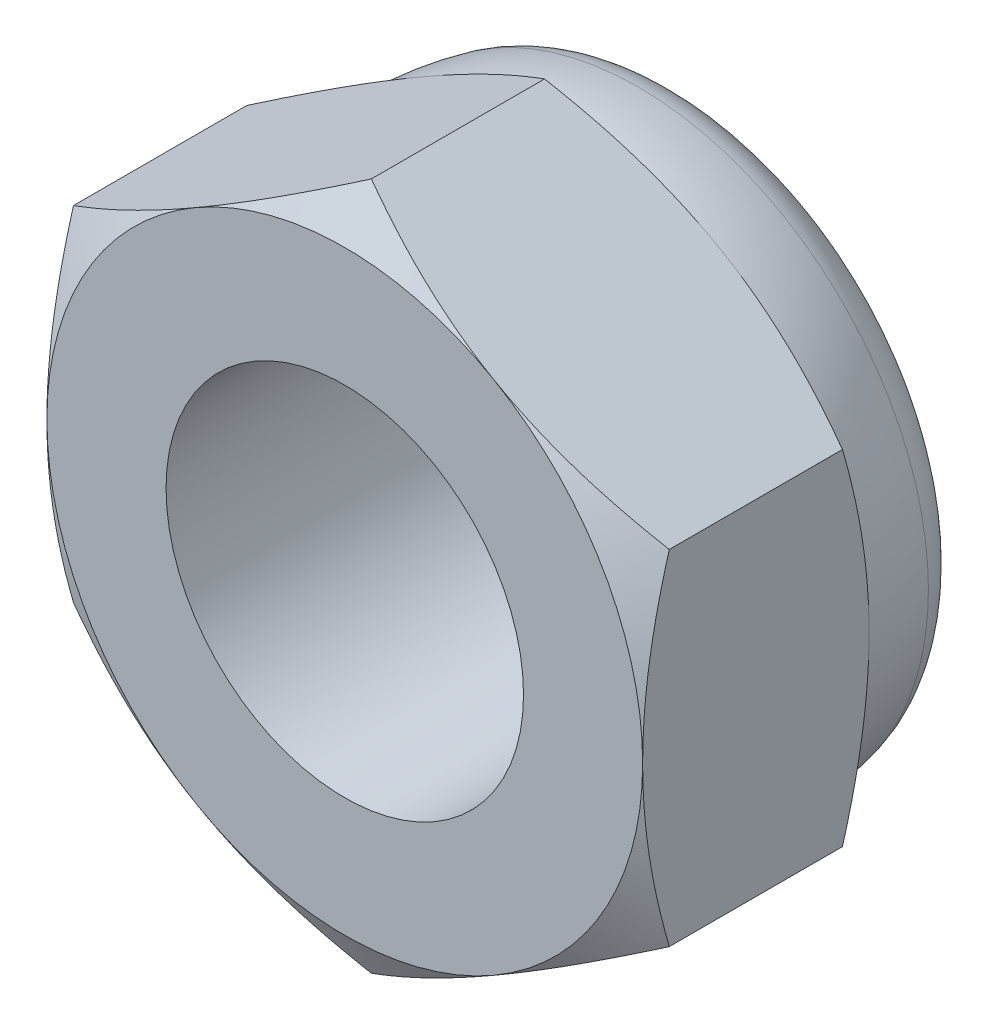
from build123d import *

# Parameters (mm, degrees)
BASE_EXTRUSION_DEPTH    = 3.8
ENL_V_MAT_EXTRU_2_DEPTH = 10.530127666
CONG_1_R                = 1
ESQUISSE3_R             = 3
ENL_V_MAT_EXTRU_1_DEPTH = 10.530127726
ESQUISSE6_W             = 0.5
ESQUISSE6_H             = 1.5


with BuildPart() as part:
    # Esquisse1 → Base-Extrusion (new body)
    with BuildSketch(Plane.XY):
        Polygon((5, -2.886751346), (5, 2.886751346), (0, 5.773502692), (-5, 2.886751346), (-5, -2.886751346), (0, -5.773502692), align=None)
    extrude(amount=-BASE_EXTRUSION_DEPTH)

    # Esquisse2 → Enl_vement de mati_re-R_volution1 (revolve, cut)
    with BuildSketch(Plane(origin=(0, 0, 0), x_dir=(1, 0, 0), z_dir=(0, 1, 0))):
        Polygon((-5, 0), (-9.290896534, 0), (-9.290896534, 3.8), (-5, 3.8), (-8.290896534, 1.9), align=None)
    revolve(axis=Axis((0, 0, -3.8), (0, 0, 1)), mode=Mode.SUBTRACT)

    # Esquisse4 → Boss.-R_vol.1 (revolve)
    with BuildSketch(Plane(origin=(0, 0, 0), x_dir=(1, 0, 0), z_dir=(0, 1, 0))):
        with BuildLine():
            Line((0, 8.8), (0, 3.8))
            Line((0, 3.8), (-5, 3.8))
            ThreePointArc((-5, 3.8), (-3.535533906, 7.335533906), (0, 8.8))
        make_face()
    revolve(axis=Axis((0, 0, 0), (0, 0, -1)))

    # Esquisse5 → Enl_v. mat.-Extru.2 (cut, through all)
    with BuildSketch(Plane.XY.offset(-5.7)):
        with BuildLine():
            ThreePointArc((5, 0), (4.330127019, 2.5), (2.5, 4.330127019))
            ThreePointArc((2.5, 4.330127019), (0, 5), (-2.5, 4.330127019))
            ThreePointArc((-2.5, 4.330127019), (-4.330127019, 2.5), (-5, 0))
            ThreePointArc((-5, 0), (-4.330127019, -2.5), (-2.5, -4.330127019))
            ThreePointArc((-2.5, -4.330127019), (0, -5), (2.5, -4.330127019))
            ThreePointArc((2.5, -4.330127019), (4.330127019, -2.5), (5, 0))
        make_face()
    extrude(amount=-ENL_V_MAT_EXTRU_2_DEPTH, mode=Mode.SUBTRACT)

    # Cong_1
    cong_1_edges = [part.edges().sort_by_distance(p)[0] for p in [
        (4.624932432, 0, -5.7),
    ]]
    fillet(cong_1_edges, radius=CONG_1_R)

    # Esquisse3 → Enl_v. mat.-Extru.1 (cut, through all)
    with BuildSketch(Plane.XY):
        Circle(ESQUISSE3_R)
    extrude(amount=-ENL_V_MAT_EXTRU_1_DEPTH, mode=Mode.SUBTRACT)

    # Esquisse6 → R_volution2 (revolve)
    with BuildSketch(Plane(origin=(0, 0, 0), x_dir=(1, 0, 0), z_dir=(0, 1, 0))):
        with Locations((2.75, 5.05)):
            Rectangle(ESQUISSE6_W, ESQUISSE6_H)
    revolve(axis=Axis((0, 0, -37.542114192), (0, 0, 1)))


solid = part.part
